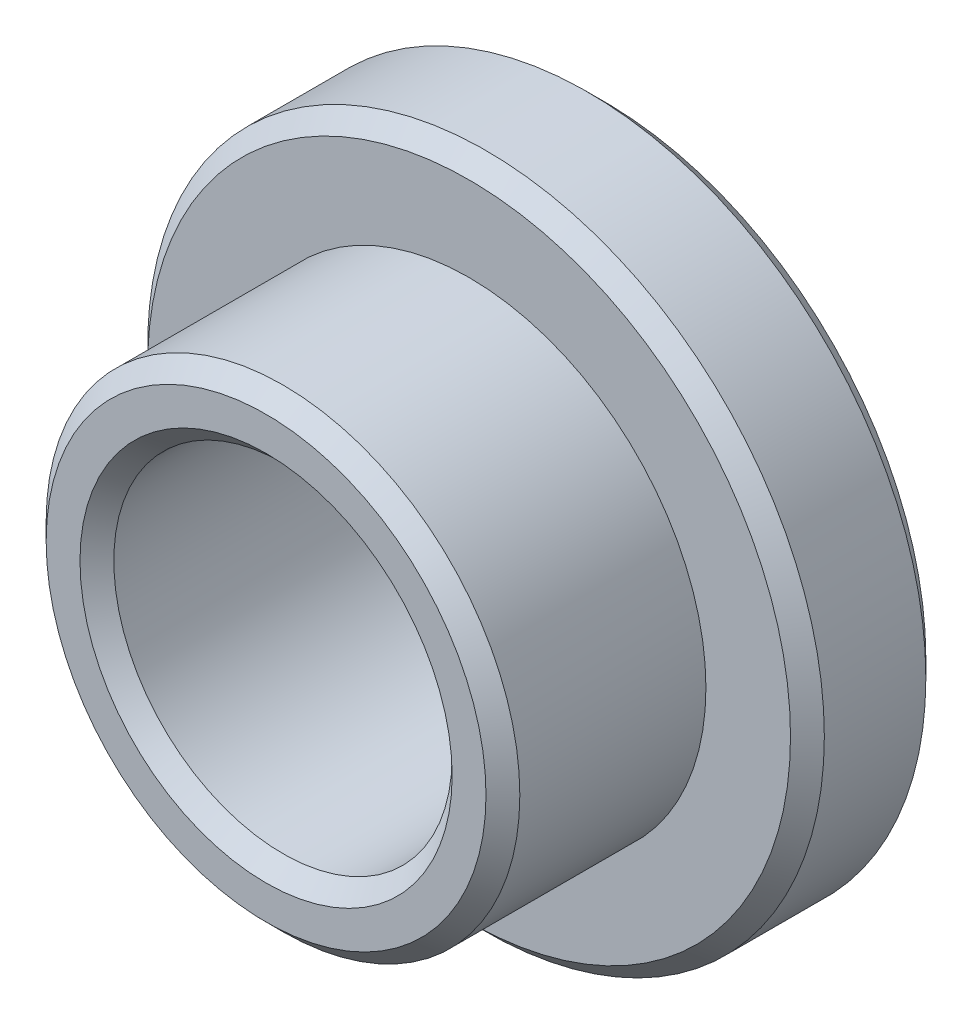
from build123d import *

# Parameters (mm, degrees)
ESQUISSE1_R             = 5
BOSS_EXTRU_1_DEPTH      = 2
ESQUISSE2_R             = 3.5
BOSS_EXTRU_2_DEPTH      = 3
ENL_V_MAT_EXTRU_1_REACH = 10.66
ESQUISSE3_R             = 2.5
CHANFREIN1_SIZE         = 0.25


with BuildPart() as part:
    # Esquisse1 → Boss.-Extru.1 (new body)
    with BuildSketch(Plane.XY):
        Circle(ESQUISSE1_R)
    extrude(amount=BOSS_EXTRU_1_DEPTH)

    # Esquisse2 → Boss.-Extru.2 (add)
    with BuildSketch(Plane.XY.offset(2)):
        Circle(ESQUISSE2_R)
    extrude(amount=BOSS_EXTRU_2_DEPTH)

    # Esquisse3 → Enl_v. mat.-Extru.1 (cut, up to next)
    with BuildSketch(Plane.XY.offset(5), mode=Mode.PRIVATE) as enl_v_mat_extru_1_sk1:
        Circle(ESQUISSE3_R)
    enl_v_mat_extru_1_tool1 = extrude(enl_v_mat_extru_1_sk1.sketch, amount=-ENL_V_MAT_EXTRU_1_REACH, mode=Mode.PRIVATE) & part.part
    add(enl_v_mat_extru_1_tool1.solids().sort_by_distance((0, 0, 5))[0], mode=Mode.SUBTRACT)

    # Chanfrein1
    chanfrein1_edges = [part.edges().sort_by_distance(p)[0] for p in [
        (-2.5, 0, 5),
        (-2.5, 0, 0),
        (-5, 0, 0),
        (-5, 0, 2),
        (-3.5, 0, 5),
    ]]
    chamfer(chanfrein1_edges, length=CHANFREIN1_SIZE)


solid = part.part
